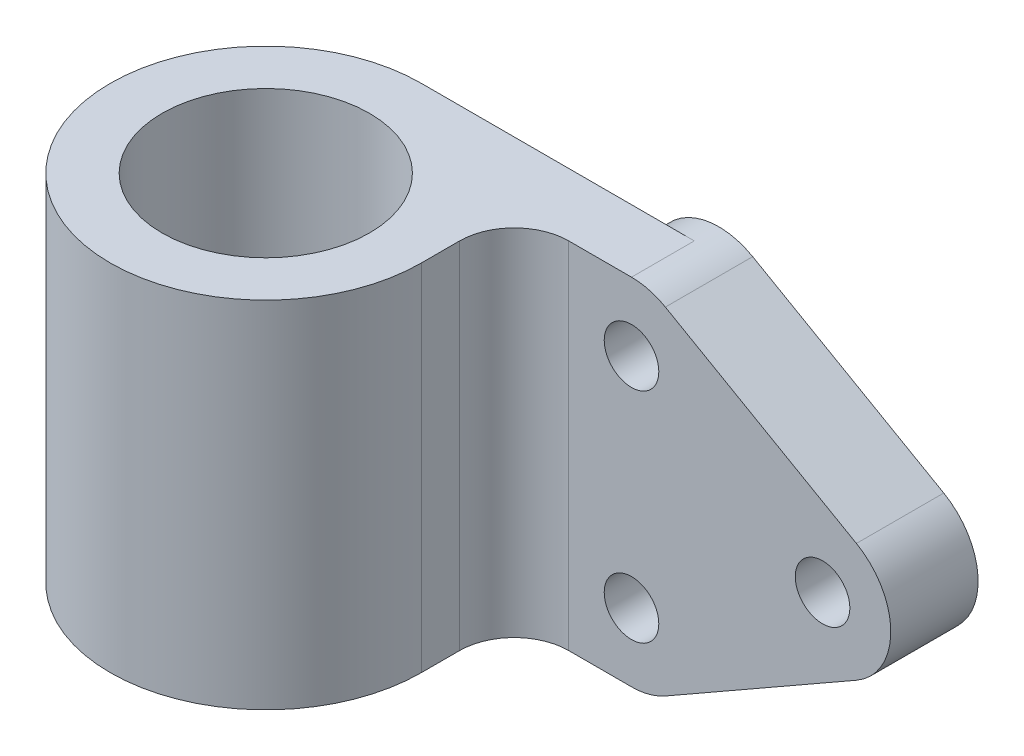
from build123d import *

# Parameters (mm, degrees)
BOSS_EXTRUDE1_DEPTH        = 8
SKETCH3_R                  = 19
BOSS_EXTRUDE2_DEPTH        = 32.5
F_10_0_10_DIAMETER_HOLE1_D = 10


with BuildPart() as part:
    # Sketch2 → Boss-Extrude1 (new, symmetric)
    with BuildSketch(Plane.XY):
        with BuildLine():
            Line((-47.5, 20), (-47.5, -20))
            ThreePointArc((-47.5, -20), (-41.274085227, -30.811376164), (-28.798263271, -30.853039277))
            Line((-28.798263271, -30.853039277), (6.201736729, -10.853039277))
            ThreePointArc((6.201736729, -10.853039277), (12.5, 0), (6.201736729, 10.853039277))
            Line((6.201736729, 10.853039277), (-28.798263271, 30.853039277))
            ThreePointArc((-28.798263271, 30.853039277), (-41.274085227, 30.811376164), (-47.5, 20))
        make_face()
    extrude(amount=BOSS_EXTRUDE1_DEPTH, both=True)

    # Sketch3 → Boss-Extrude2 (add, symmetric)
    with BuildSketch(Plane(origin=(0, 0, 0), x_dir=(1, 0, 0), z_dir=(0, 1, 0))):
        with BuildLine():
            Line((-56.5, -25), (-56.5, -18))
            ThreePointArc((-56.5, -18), (-53.571067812, -10.928932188), (-46.5, -8))
            Line((-46.5, -8), (-35, -8))
            Line((-35, -8), (-35, 3.5))
            Line((-35, 3.5), (-85, 3.5))
            ThreePointArc((-85, 3.5), (-105.152543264, -45.152543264), (-56.5, -25))
        make_face()
        with Locations(Location((-85, -25, 0), (0, 0, 270))):
            Circle(SKETCH3_R, mode=Mode.SUBTRACT)
    extrude(amount=BOSS_EXTRUDE2_DEPTH, both=True)

    # 10.0 _10_ Diameter Hole1 (through all)
    with Locations(Plane(origin=(0, 0, -8), x_dir=(-1, 0, 0), z_dir=(0, 0, -1))):
        with Locations((0, 0), (35, 20), (35, -20)):
            Hole(F_10_0_10_DIAMETER_HOLE1_D / 2)


solid = part.part
